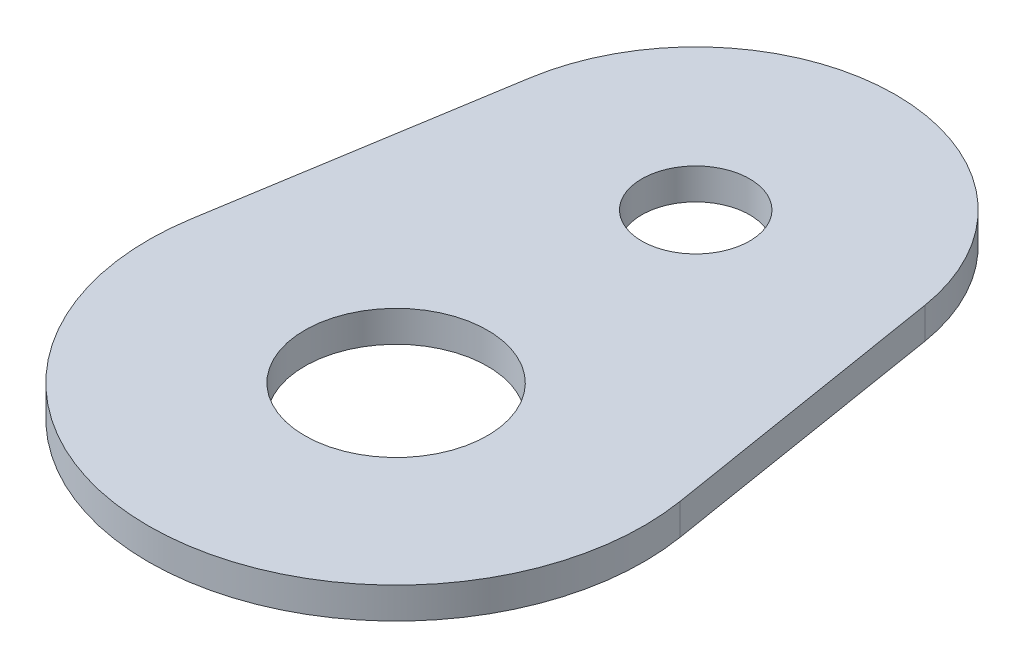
ISO-10303-21;
HEADER;
FILE_DESCRIPTION(('STEP AP214'),'2;1');
FILE_NAME('part.step','',(''),(''),'','','');
FILE_SCHEMA(('AUTOMOTIVE_DESIGN { 1 0 10303 214 1 1 1 1 }'));
ENDSEC;
DATA;
#1=APPLICATION_CONTEXT('core data for automotive mechanical design processes');
#2=APPLICATION_PROTOCOL_DEFINITION('international standard','automotive_design',2000,#1);
#3=PRODUCT_CONTEXT('',#1,'mechanical');
#4=PRODUCT('Part','Part','',(#3));
#5=PRODUCT_RELATED_PRODUCT_CATEGORY('part','',(#4));
#6=PRODUCT_DEFINITION_FORMATION('','',#4);
#7=PRODUCT_DEFINITION_CONTEXT('part definition',#1,'design');
#8=PRODUCT_DEFINITION('design','',#6,#7);
#9=PRODUCT_DEFINITION_SHAPE('','',#8);
#10=(LENGTH_UNIT() NAMED_UNIT(*) SI_UNIT(.MILLI.,.METRE.));
#11=(NAMED_UNIT(*) PLANE_ANGLE_UNIT() SI_UNIT($,.RADIAN.));
#12=(NAMED_UNIT(*) SI_UNIT($,.STERADIAN.) SOLID_ANGLE_UNIT());
#13=UNCERTAINTY_MEASURE_WITH_UNIT(LENGTH_MEASURE(1.E-05),#10,'distance_accuracy_value','');
#14=(GEOMETRIC_REPRESENTATION_CONTEXT(3) GLOBAL_UNCERTAINTY_ASSIGNED_CONTEXT((#13)) GLOBAL_UNIT_ASSIGNED_CONTEXT((#10,
#11,#12)) REPRESENTATION_CONTEXT('',''));
#15=CARTESIAN_POINT('',(0.,0.,0.));
#16=DIRECTION('',(0.,0.,1.));
#17=DIRECTION('',(1.,0.,0.));
#18=AXIS2_PLACEMENT_3D('',#15,#16,#17);
#19=CARTESIAN_POINT('',(0.,1.9812,0.));
#20=DIRECTION('',(0.,-1.,0.));
#21=DIRECTION('',(0.,0.,-1.));
#22=AXIS2_PLACEMENT_3D('',#19,#20,#21);
#23=CYLINDRICAL_SURFACE('',#22,12.7);
#24=CARTESIAN_POINT('',(0.,0.,0.));
#25=DIRECTION('',(0.,1.,0.));
#26=DIRECTION('',(0.,0.,-1.));
#27=AXIS2_PLACEMENT_3D('',#24,#25,#26);
#28=CIRCLE('',#27,12.7);
#29=CARTESIAN_POINT('',(12.5363860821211,0.,-2.032));
#30=VERTEX_POINT('',#29);
#31=CARTESIAN_POINT('',(-12.5363860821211,0.,-2.032));
#32=VERTEX_POINT('',#31);
#33=EDGE_CURVE('E71',#30,#32,#28,.T.);
#34=ORIENTED_EDGE('',*,*,#33,.T.);
#35=DIRECTION('',(0.,-1.,0.));
#36=VECTOR('',#35,1.);
#37=CARTESIAN_POINT('',(-12.5363860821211,1.9812,-2.032));
#38=LINE('',#37,#36);
#39=CARTESIAN_POINT('',(-12.5363860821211,1.9812,-2.032));
#40=VERTEX_POINT('',#39);
#41=EDGE_CURVE('E11',#40,#32,#38,.T.);
#42=ORIENTED_EDGE('',*,*,#41,.F.);
#43=CARTESIAN_POINT('',(0.,1.9812,0.));
#44=DIRECTION('',(0.,1.,0.));
#45=DIRECTION('',(0.,0.,-1.));
#46=AXIS2_PLACEMENT_3D('',#43,#44,#45);
#47=CIRCLE('',#46,12.7);
#48=CARTESIAN_POINT('',(12.5363860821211,1.9812,-2.032));
#49=VERTEX_POINT('',#48);
#50=EDGE_CURVE('E94',#49,#40,#47,.T.);
#51=ORIENTED_EDGE('',*,*,#50,.F.);
#52=DIRECTION('',(0.,-1.,0.));
#53=VECTOR('',#52,1.);
#54=CARTESIAN_POINT('',(12.5363860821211,1.9812,-2.032));
#55=LINE('',#54,#53);
#56=EDGE_CURVE('E83',#49,#30,#55,.T.);
#57=ORIENTED_EDGE('',*,*,#56,.T.);
#58=EDGE_LOOP('',(#34,#42,#51,#57));
#59=FACE_BOUND('',#58,.T.);
#60=ADVANCED_FACE('F27',(#59),#23,.T.);
#61=CARTESIAN_POINT('',(-15.5451187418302,1.9812,16.53032));
#62=DIRECTION('',(0.987117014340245,0.,0.16));
#63=DIRECTION('',(0.16,0.,-0.987117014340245));
#64=AXIS2_PLACEMENT_3D('',#61,#62,#63);
#65=PLANE('',#64);
#66=DIRECTION('',(-0.16,0.,0.987117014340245));
#67=VECTOR('',#66,1.);
#68=CARTESIAN_POINT('',(-15.5451187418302,0.,16.53032));
#69=LINE('',#68,#67);
#70=CARTESIAN_POINT('',(-15.5451187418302,0.,16.53032));
#71=VERTEX_POINT('',#70);
#72=EDGE_CURVE('E67',#32,#71,#69,.T.);
#73=ORIENTED_EDGE('',*,*,#72,.T.);
#74=DIRECTION('',(0.,-1.,0.));
#75=VECTOR('',#74,1.);
#76=CARTESIAN_POINT('',(-15.5451187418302,1.9812,16.53032));
#77=LINE('',#76,#75);
#78=CARTESIAN_POINT('',(-15.5451187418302,1.9812,16.53032));
#79=VERTEX_POINT('',#78);
#80=EDGE_CURVE('E34',#79,#71,#77,.T.);
#81=ORIENTED_EDGE('',*,*,#80,.F.);
#82=DIRECTION('',(-0.16,0.,0.987117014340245));
#83=VECTOR('',#82,1.);
#84=CARTESIAN_POINT('',(-15.5451187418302,1.9812,16.53032));
#85=LINE('',#84,#83);
#86=EDGE_CURVE('E79',#40,#79,#85,.T.);
#87=ORIENTED_EDGE('',*,*,#86,.F.);
#88=ORIENTED_EDGE('',*,*,#41,.T.);
#89=EDGE_LOOP('',(#73,#81,#87,#88));
#90=FACE_BOUND('',#89,.T.);
#91=ADVANCED_FACE('F78',(#90),#65,.F.);
#92=CARTESIAN_POINT('',(0.,1.9812,19.05));
#93=DIRECTION('',(0.,-1.,0.));
#94=DIRECTION('',(0.,0.,-1.));
#95=AXIS2_PLACEMENT_3D('',#92,#93,#94);
#96=CYLINDRICAL_SURFACE('',#95,15.748);
#97=CARTESIAN_POINT('',(0.,0.,19.05));
#98=DIRECTION('',(0.,1.,0.));
#99=DIRECTION('',(0.,0.,-1.));
#100=AXIS2_PLACEMENT_3D('',#97,#98,#99);
#101=CIRCLE('',#100,15.748);
#102=CARTESIAN_POINT('',(15.5451187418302,0.,16.53032));
#103=VERTEX_POINT('',#102);
#104=EDGE_CURVE('E72',#71,#103,#101,.T.);
#105=ORIENTED_EDGE('',*,*,#104,.T.);
#106=DIRECTION('',(0.,-1.,0.));
#107=VECTOR('',#106,1.);
#108=CARTESIAN_POINT('',(15.5451187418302,1.9812,16.53032));
#109=LINE('',#108,#107);
#110=CARTESIAN_POINT('',(15.5451187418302,1.9812,16.53032));
#111=VERTEX_POINT('',#110);
#112=EDGE_CURVE('E100',#111,#103,#109,.T.);
#113=ORIENTED_EDGE('',*,*,#112,.F.);
#114=CARTESIAN_POINT('',(0.,1.9812,19.05));
#115=DIRECTION('',(0.,1.,0.));
#116=DIRECTION('',(0.,0.,-1.));
#117=AXIS2_PLACEMENT_3D('',#114,#115,#116);
#118=CIRCLE('',#117,15.748);
#119=EDGE_CURVE('E46',#79,#111,#118,.T.);
#120=ORIENTED_EDGE('',*,*,#119,.F.);
#121=ORIENTED_EDGE('',*,*,#80,.T.);
#122=EDGE_LOOP('',(#105,#113,#120,#121));
#123=FACE_BOUND('',#122,.T.);
#124=ADVANCED_FACE('F103',(#123),#96,.T.);
#125=CARTESIAN_POINT('',(12.5363860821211,1.9812,-2.032));
#126=DIRECTION('',(-0.987117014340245,0.,0.16));
#127=DIRECTION('',(0.16,0.,0.987117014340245));
#128=AXIS2_PLACEMENT_3D('',#125,#126,#127);
#129=PLANE('',#128);
#130=DIRECTION('',(-0.16,0.,-0.987117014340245));
#131=VECTOR('',#130,1.);
#132=CARTESIAN_POINT('',(12.5363860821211,0.,-2.032));
#133=LINE('',#132,#131);
#134=EDGE_CURVE('E92',#103,#30,#133,.T.);
#135=ORIENTED_EDGE('',*,*,#134,.T.);
#136=ORIENTED_EDGE('',*,*,#56,.F.);
#137=DIRECTION('',(-0.16,0.,-0.987117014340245));
#138=VECTOR('',#137,1.);
#139=CARTESIAN_POINT('',(12.5363860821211,1.9812,-2.032));
#140=LINE('',#139,#138);
#141=EDGE_CURVE('E41',#111,#49,#140,.T.);
#142=ORIENTED_EDGE('',*,*,#141,.F.);
#143=ORIENTED_EDGE('',*,*,#112,.T.);
#144=EDGE_LOOP('',(#135,#136,#142,#143));
#145=FACE_BOUND('',#144,.T.);
#146=ADVANCED_FACE('F105',(#145),#129,.F.);
#147=CARTESIAN_POINT('',(0.,1.9812,0.));
#148=DIRECTION('',(0.,-1.,0.));
#149=DIRECTION('',(0.,0.,-1.));
#150=AXIS2_PLACEMENT_3D('',#147,#148,#149);
#151=PLANE('',#150);
#152=CARTESIAN_POINT('',(0.,1.9812,19.05));
#153=DIRECTION('',(0.,1.,0.));
#154=DIRECTION('',(0.,0.,1.));
#155=AXIS2_PLACEMENT_3D('',#152,#153,#154);
#156=CIRCLE('',#155,5.81025);
#157=CARTESIAN_POINT('',(0.,1.9812,24.86025));
#158=VERTEX_POINT('',#157);
#159=EDGE_CURVE('E162',#158,#158,#156,.T.);
#160=ORIENTED_EDGE('',*,*,#159,.F.);
#161=EDGE_LOOP('',(#160));
#162=FACE_BOUND('',#161,.T.);
#163=CARTESIAN_POINT('',(2.58473797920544E-13,1.9812,-1.2490009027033E-13));
#164=DIRECTION('',(0.,1.,0.));
#165=DIRECTION('',(0.,0.,1.));
#166=AXIS2_PLACEMENT_3D('',#163,#164,#165);
#167=CIRCLE('',#166,3.429);
#168=CARTESIAN_POINT('',(2.58473797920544E-13,1.9812,3.42899999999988));
#169=VERTEX_POINT('',#168);
#170=EDGE_CURVE('E87',#169,#169,#167,.T.);
#171=ORIENTED_EDGE('',*,*,#170,.F.);
#172=EDGE_LOOP('',(#171));
#173=FACE_BOUND('',#172,.T.);
#174=ORIENTED_EDGE('',*,*,#50,.T.);
#175=ORIENTED_EDGE('',*,*,#86,.T.);
#176=ORIENTED_EDGE('',*,*,#119,.T.);
#177=ORIENTED_EDGE('',*,*,#141,.T.);
#178=EDGE_LOOP('',(#174,#175,#176,#177));
#179=FACE_BOUND('',#178,.T.);
#180=ADVANCED_FACE('F106',(#162,#173,#179),#151,.F.);
#181=CARTESIAN_POINT('',(0.,0.,0.));
#182=DIRECTION('',(0.,-1.,0.));
#183=DIRECTION('',(0.,0.,-1.));
#184=AXIS2_PLACEMENT_3D('',#181,#182,#183);
#185=PLANE('',#184);
#186=CARTESIAN_POINT('',(0.,0.,19.05));
#187=DIRECTION('',(0.,1.,0.));
#188=DIRECTION('',(0.,0.,1.));
#189=AXIS2_PLACEMENT_3D('',#186,#187,#188);
#190=CIRCLE('',#189,5.81025);
#191=CARTESIAN_POINT('',(0.,0.,24.86025));
#192=VERTEX_POINT('',#191);
#193=EDGE_CURVE('E160',#192,#192,#190,.T.);
#194=ORIENTED_EDGE('',*,*,#193,.T.);
#195=EDGE_LOOP('',(#194));
#196=FACE_BOUND('',#195,.T.);
#197=CARTESIAN_POINT('',(2.58473797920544E-13,0.,-1.2490009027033E-13));
#198=DIRECTION('',(0.,1.,0.));
#199=DIRECTION('',(0.,0.,1.));
#200=AXIS2_PLACEMENT_3D('',#197,#198,#199);
#201=CIRCLE('',#200,3.429);
#202=CARTESIAN_POINT('',(2.58473797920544E-13,0.,3.42899999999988));
#203=VERTEX_POINT('',#202);
#204=EDGE_CURVE('E84',#203,#203,#201,.T.);
#205=ORIENTED_EDGE('',*,*,#204,.T.);
#206=EDGE_LOOP('',(#205));
#207=FACE_BOUND('',#206,.T.);
#208=ORIENTED_EDGE('',*,*,#33,.F.);
#209=ORIENTED_EDGE('',*,*,#134,.F.);
#210=ORIENTED_EDGE('',*,*,#104,.F.);
#211=ORIENTED_EDGE('',*,*,#72,.F.);
#212=EDGE_LOOP('',(#208,#209,#210,#211));
#213=FACE_BOUND('',#212,.T.);
#214=ADVANCED_FACE('F68',(#196,#207,#213),#185,.T.);
#215=CARTESIAN_POINT('',(2.58473797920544E-13,0.,-1.2490009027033E-13));
#216=DIRECTION('',(0.,1.,0.));
#217=DIRECTION('',(0.,0.,1.));
#218=AXIS2_PLACEMENT_3D('',#215,#216,#217);
#219=CYLINDRICAL_SURFACE('',#218,3.429);
#220=ORIENTED_EDGE('',*,*,#204,.F.);
#221=EDGE_LOOP('',(#220));
#222=FACE_BOUND('',#221,.T.);
#223=ORIENTED_EDGE('',*,*,#170,.T.);
#224=EDGE_LOOP('',(#223));
#225=FACE_BOUND('',#224,.T.);
#226=ADVANCED_FACE('F114',(#222,#225),#219,.F.);
#227=CARTESIAN_POINT('',(0.,0.,19.05));
#228=DIRECTION('',(0.,1.,0.));
#229=DIRECTION('',(0.,0.,1.));
#230=AXIS2_PLACEMENT_3D('',#227,#228,#229);
#231=CYLINDRICAL_SURFACE('',#230,5.81025);
#232=ORIENTED_EDGE('',*,*,#193,.F.);
#233=EDGE_LOOP('',(#232));
#234=FACE_BOUND('',#233,.T.);
#235=ORIENTED_EDGE('',*,*,#159,.T.);
#236=EDGE_LOOP('',(#235));
#237=FACE_BOUND('',#236,.T.);
#238=ADVANCED_FACE('F147',(#234,#237),#231,.F.);
#239=CLOSED_SHELL('',(#60,#91,#124,#146,#180,#214,#226,#238));
#240=MANIFOLD_SOLID_BREP('B2',#239);
#241=ADVANCED_BREP_SHAPE_REPRESENTATION('',(#18,#240),#14);
#242=SHAPE_DEFINITION_REPRESENTATION(#9,#241);
ENDSEC;
END-ISO-10303-21;
